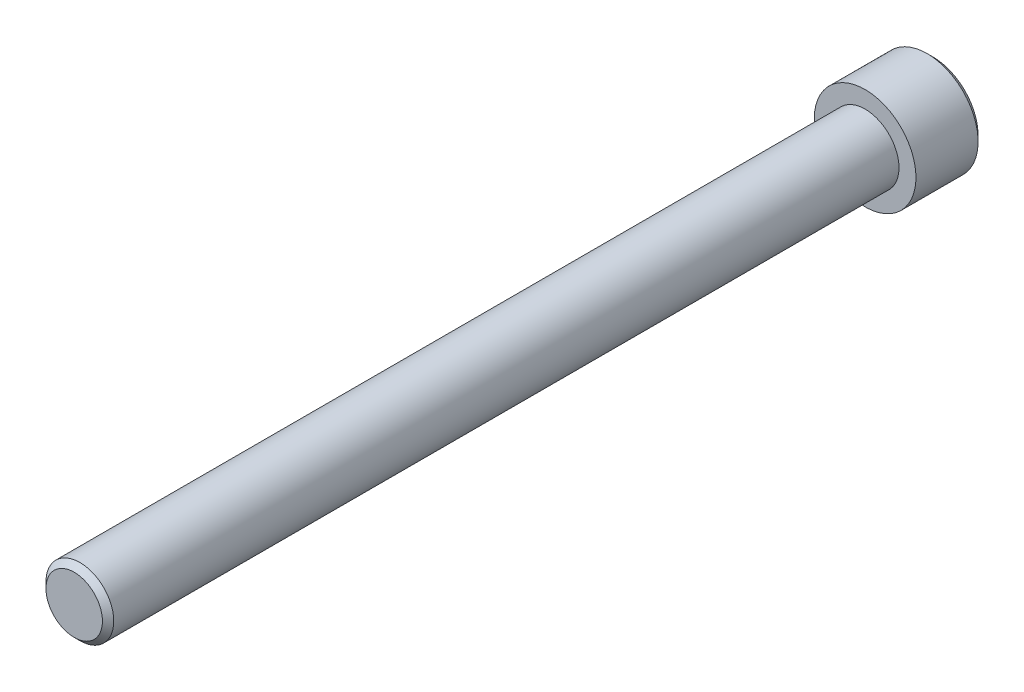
ISO-10303-21;
HEADER;
FILE_DESCRIPTION(('STEP AP214'),'2;1');
FILE_NAME('part.step','',(''),(''),'','','');
FILE_SCHEMA(('AUTOMOTIVE_DESIGN { 1 0 10303 214 1 1 1 1 }'));
ENDSEC;
DATA;
#1=APPLICATION_CONTEXT('core data for automotive mechanical design processes');
#2=APPLICATION_PROTOCOL_DEFINITION('international standard','automotive_design',2000,#1);
#3=PRODUCT_CONTEXT('',#1,'mechanical');
#4=PRODUCT('Part','Part','',(#3));
#5=PRODUCT_RELATED_PRODUCT_CATEGORY('part','',(#4));
#6=PRODUCT_DEFINITION_FORMATION('','',#4);
#7=PRODUCT_DEFINITION_CONTEXT('part definition',#1,'design');
#8=PRODUCT_DEFINITION('design','',#6,#7);
#9=PRODUCT_DEFINITION_SHAPE('','',#8);
#10=(LENGTH_UNIT() NAMED_UNIT(*) SI_UNIT(.MILLI.,.METRE.));
#11=(NAMED_UNIT(*) PLANE_ANGLE_UNIT() SI_UNIT($,.RADIAN.));
#12=(NAMED_UNIT(*) SI_UNIT($,.STERADIAN.) SOLID_ANGLE_UNIT());
#13=UNCERTAINTY_MEASURE_WITH_UNIT(LENGTH_MEASURE(1.E-05),#10,'distance_accuracy_value','');
#14=(GEOMETRIC_REPRESENTATION_CONTEXT(3) GLOBAL_UNCERTAINTY_ASSIGNED_CONTEXT((#13)) GLOBAL_UNIT_ASSIGNED_CONTEXT((#10,
#11,#12)) REPRESENTATION_CONTEXT('',''));
#15=CARTESIAN_POINT('',(0.,0.,0.));
#16=DIRECTION('',(0.,0.,1.));
#17=DIRECTION('',(1.,0.,0.));
#18=AXIS2_PLACEMENT_3D('',#15,#16,#17);
#19=CARTESIAN_POINT('',(-142.,124.,-191.5));
#20=DIRECTION('',(0.,0.,-1.));
#21=DIRECTION('',(-1.,0.,0.));
#22=AXIS2_PLACEMENT_3D('',#19,#20,#21);
#23=PLANE('',#22);
#24=DIRECTION('',(0.5,-0.866025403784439,0.));
#25=VECTOR('',#24,1.);
#26=CARTESIAN_POINT('',(-139.113248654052,129.,-191.5));
#27=LINE('',#26,#25);
#28=CARTESIAN_POINT('',(-139.113248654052,129.,-191.5));
#29=VERTEX_POINT('',#28);
#30=CARTESIAN_POINT('',(-136.226497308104,124.,-191.5));
#31=VERTEX_POINT('',#30);
#32=EDGE_CURVE('E291',#29,#31,#27,.T.);
#33=ORIENTED_EDGE('',*,*,#32,.F.);
#34=DIRECTION('',(1.,0.,0.));
#35=VECTOR('',#34,1.);
#36=CARTESIAN_POINT('',(-144.886751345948,129.,-191.5));
#37=LINE('',#36,#35);
#38=CARTESIAN_POINT('',(-144.886751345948,129.,-191.5));
#39=VERTEX_POINT('',#38);
#40=EDGE_CURVE('E88',#39,#29,#37,.T.);
#41=ORIENTED_EDGE('',*,*,#40,.F.);
#42=DIRECTION('',(0.5,0.866025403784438,0.));
#43=VECTOR('',#42,1.);
#44=CARTESIAN_POINT('',(-147.773502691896,124.,-191.5));
#45=LINE('',#44,#43);
#46=CARTESIAN_POINT('',(-147.773502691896,124.,-191.5));
#47=VERTEX_POINT('',#46);
#48=EDGE_CURVE('E31',#47,#39,#45,.T.);
#49=ORIENTED_EDGE('',*,*,#48,.F.);
#50=DIRECTION('',(-0.5,0.86602540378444,0.));
#51=VECTOR('',#50,1.);
#52=CARTESIAN_POINT('',(-144.886751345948,119.,-191.5));
#53=LINE('',#52,#51);
#54=CARTESIAN_POINT('',(-144.886751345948,119.,-191.5));
#55=VERTEX_POINT('',#54);
#56=EDGE_CURVE('E66',#55,#47,#53,.T.);
#57=ORIENTED_EDGE('',*,*,#56,.F.);
#58=DIRECTION('',(-1.,0.,0.));
#59=VECTOR('',#58,1.);
#60=CARTESIAN_POINT('',(-139.113248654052,119.,-191.5));
#61=LINE('',#60,#59);
#62=CARTESIAN_POINT('',(-139.113248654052,119.,-191.5));
#63=VERTEX_POINT('',#62);
#64=EDGE_CURVE('E76',#63,#55,#61,.T.);
#65=ORIENTED_EDGE('',*,*,#64,.F.);
#66=DIRECTION('',(-0.5,-0.866025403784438,0.));
#67=VECTOR('',#66,1.);
#68=CARTESIAN_POINT('',(-136.226497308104,124.,-191.5));
#69=LINE('',#68,#67);
#70=EDGE_CURVE('E82',#31,#63,#69,.T.);
#71=ORIENTED_EDGE('',*,*,#70,.F.);
#72=EDGE_LOOP('',(#33,#41,#49,#57,#65,#71));
#73=FACE_BOUND('',#72,.T.);
#74=CARTESIAN_POINT('',(-142.,124.,-191.5));
#75=DIRECTION('',(0.,0.,-1.));
#76=DIRECTION('',(-1.,0.,0.));
#77=AXIS2_PLACEMENT_3D('',#74,#75,#76);
#78=CIRCLE('',#77,8.);
#79=CARTESIAN_POINT('',(-150.,124.,-191.5));
#80=VERTEX_POINT('',#79);
#81=EDGE_CURVE('E110',#80,#80,#78,.T.);
#82=ORIENTED_EDGE('',*,*,#81,.T.);
#83=EDGE_LOOP('',(#82));
#84=FACE_BOUND('',#83,.T.);
#85=ADVANCED_FACE('F16',(#73,#84),#23,.T.);
#86=CARTESIAN_POINT('',(-142.,124.,-179.5));
#87=DIRECTION('',(0.,0.,1.));
#88=DIRECTION('',(1.,0.,0.));
#89=AXIS2_PLACEMENT_3D('',#86,#87,#88);
#90=PLANE('',#89);
#91=CARTESIAN_POINT('',(-142.,124.,-179.5));
#92=DIRECTION('',(0.,0.,1.));
#93=DIRECTION('',(1.,0.,0.));
#94=AXIS2_PLACEMENT_3D('',#91,#92,#93);
#95=CIRCLE('',#94,6.);
#96=CARTESIAN_POINT('',(-136.,124.,-179.5));
#97=VERTEX_POINT('',#96);
#98=EDGE_CURVE('E113',#97,#97,#95,.T.);
#99=ORIENTED_EDGE('',*,*,#98,.F.);
#100=EDGE_LOOP('',(#99));
#101=FACE_BOUND('',#100,.T.);
#102=CARTESIAN_POINT('',(-142.,124.,-179.5));
#103=DIRECTION('',(0.,0.,-1.));
#104=DIRECTION('',(-1.,0.,0.));
#105=AXIS2_PLACEMENT_3D('',#102,#103,#104);
#106=CIRCLE('',#105,9.);
#107=CARTESIAN_POINT('',(-151.,124.,-179.5));
#108=VERTEX_POINT('',#107);
#109=EDGE_CURVE('E102',#108,#108,#106,.T.);
#110=ORIENTED_EDGE('',*,*,#109,.F.);
#111=EDGE_LOOP('',(#110));
#112=FACE_BOUND('',#111,.T.);
#113=ADVANCED_FACE('F132',(#101,#112),#90,.T.);
#114=CARTESIAN_POINT('',(-142.,124.,-179.5));
#115=DIRECTION('',(0.,0.,-1.));
#116=DIRECTION('',(-1.,0.,0.));
#117=AXIS2_PLACEMENT_3D('',#114,#115,#116);
#118=CYLINDRICAL_SURFACE('',#117,9.);
#119=CARTESIAN_POINT('',(-142.,124.,-190.5));
#120=DIRECTION('',(0.,0.,-1.));
#121=DIRECTION('',(-1.,0.,0.));
#122=AXIS2_PLACEMENT_3D('',#119,#120,#121);
#123=CIRCLE('',#122,9.);
#124=CARTESIAN_POINT('',(-151.,124.,-190.5));
#125=VERTEX_POINT('',#124);
#126=EDGE_CURVE('E107',#125,#125,#123,.F.);
#127=ORIENTED_EDGE('',*,*,#126,.T.);
#128=EDGE_LOOP('',(#127));
#129=FACE_BOUND('',#128,.T.);
#130=ORIENTED_EDGE('',*,*,#109,.T.);
#131=EDGE_LOOP('',(#130));
#132=FACE_BOUND('',#131,.T.);
#133=ADVANCED_FACE('F137',(#129,#132),#118,.T.);
#134=CARTESIAN_POINT('',(-142.,124.,-190.5));
#135=DIRECTION('',(0.,0.,1.));
#136=DIRECTION('',(1.,0.,0.));
#137=AXIS2_PLACEMENT_3D('',#134,#135,#136);
#138=CONICAL_SURFACE('',#137,9.,0.785398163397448);
#139=ORIENTED_EDGE('',*,*,#81,.F.);
#140=EDGE_LOOP('',(#139));
#141=FACE_BOUND('',#140,.T.);
#142=ORIENTED_EDGE('',*,*,#126,.F.);
#143=EDGE_LOOP('',(#142));
#144=FACE_BOUND('',#143,.T.);
#145=ADVANCED_FACE('F143',(#141,#144),#138,.T.);
#146=CARTESIAN_POINT('',(-139.113248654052,129.,-185.5));
#147=DIRECTION('',(0.866025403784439,0.5,0.));
#148=DIRECTION('',(-0.5,0.866025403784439,0.));
#149=AXIS2_PLACEMENT_3D('',#146,#147,#148);
#150=PLANE('',#149);
#151=ORIENTED_EDGE('',*,*,#32,.T.);
#152=DIRECTION('',(0.,0.,-1.));
#153=VECTOR('',#152,1.);
#154=CARTESIAN_POINT('',(-136.226497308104,124.,-185.5));
#155=LINE('',#154,#153);
#156=CARTESIAN_POINT('',(-136.226497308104,124.,-185.5));
#157=VERTEX_POINT('',#156);
#158=EDGE_CURVE('E100',#157,#31,#155,.T.);
#159=ORIENTED_EDGE('',*,*,#158,.F.);
#160=DIRECTION('',(0.5,-0.866025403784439,0.));
#161=VECTOR('',#160,1.);
#162=CARTESIAN_POINT('',(-139.113248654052,129.,-185.5));
#163=LINE('',#162,#161);
#164=CARTESIAN_POINT('',(-139.113248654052,129.,-185.5));
#165=VERTEX_POINT('',#164);
#166=EDGE_CURVE('E94',#165,#157,#163,.T.);
#167=ORIENTED_EDGE('',*,*,#166,.F.);
#168=DIRECTION('',(0.,0.,-1.));
#169=VECTOR('',#168,1.);
#170=CARTESIAN_POINT('',(-139.113248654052,129.,-185.5));
#171=LINE('',#170,#169);
#172=EDGE_CURVE('E97',#165,#29,#171,.T.);
#173=ORIENTED_EDGE('',*,*,#172,.T.);
#174=EDGE_LOOP('',(#151,#159,#167,#173));
#175=FACE_BOUND('',#174,.T.);
#176=ADVANCED_FACE('F146',(#175),#150,.F.);
#177=CARTESIAN_POINT('',(-136.226497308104,124.,-185.5));
#178=DIRECTION('',(0.866025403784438,-0.5,0.));
#179=DIRECTION('',(0.5,0.866025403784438,0.));
#180=AXIS2_PLACEMENT_3D('',#177,#178,#179);
#181=PLANE('',#180);
#182=ORIENTED_EDGE('',*,*,#70,.T.);
#183=DIRECTION('',(0.,0.,-1.));
#184=VECTOR('',#183,1.);
#185=CARTESIAN_POINT('',(-139.113248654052,119.,-185.5));
#186=LINE('',#185,#184);
#187=CARTESIAN_POINT('',(-139.113248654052,119.,-185.5));
#188=VERTEX_POINT('',#187);
#189=EDGE_CURVE('E72',#188,#63,#186,.T.);
#190=ORIENTED_EDGE('',*,*,#189,.F.);
#191=DIRECTION('',(-0.5,-0.866025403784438,0.));
#192=VECTOR('',#191,1.);
#193=CARTESIAN_POINT('',(-136.226497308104,124.,-185.5));
#194=LINE('',#193,#192);
#195=EDGE_CURVE('E288',#157,#188,#194,.T.);
#196=ORIENTED_EDGE('',*,*,#195,.F.);
#197=ORIENTED_EDGE('',*,*,#158,.T.);
#198=EDGE_LOOP('',(#182,#190,#196,#197));
#199=FACE_BOUND('',#198,.T.);
#200=ADVANCED_FACE('F151',(#199),#181,.F.);
#201=CARTESIAN_POINT('',(-139.113248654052,119.,-185.5));
#202=DIRECTION('',(0.,-1.,0.));
#203=DIRECTION('',(1.,0.,0.));
#204=AXIS2_PLACEMENT_3D('',#201,#202,#203);
#205=PLANE('',#204);
#206=ORIENTED_EDGE('',*,*,#64,.T.);
#207=DIRECTION('',(0.,0.,-1.));
#208=VECTOR('',#207,1.);
#209=CARTESIAN_POINT('',(-144.886751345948,119.,-185.5));
#210=LINE('',#209,#208);
#211=CARTESIAN_POINT('',(-144.886751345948,119.,-185.5));
#212=VERTEX_POINT('',#211);
#213=EDGE_CURVE('E61',#212,#55,#210,.T.);
#214=ORIENTED_EDGE('',*,*,#213,.F.);
#215=DIRECTION('',(-1.,0.,0.));
#216=VECTOR('',#215,1.);
#217=CARTESIAN_POINT('',(-139.113248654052,119.,-185.5));
#218=LINE('',#217,#216);
#219=EDGE_CURVE('E294',#188,#212,#218,.T.);
#220=ORIENTED_EDGE('',*,*,#219,.F.);
#221=ORIENTED_EDGE('',*,*,#189,.T.);
#222=EDGE_LOOP('',(#206,#214,#220,#221));
#223=FACE_BOUND('',#222,.T.);
#224=ADVANCED_FACE('F77',(#223),#205,.F.);
#225=CARTESIAN_POINT('',(-144.886751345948,119.,-185.5));
#226=DIRECTION('',(-0.86602540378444,-0.5,0.));
#227=DIRECTION('',(0.5,-0.86602540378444,0.));
#228=AXIS2_PLACEMENT_3D('',#225,#226,#227);
#229=PLANE('',#228);
#230=ORIENTED_EDGE('',*,*,#56,.T.);
#231=DIRECTION('',(0.,0.,-1.));
#232=VECTOR('',#231,1.);
#233=CARTESIAN_POINT('',(-147.773502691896,124.,-185.5));
#234=LINE('',#233,#232);
#235=CARTESIAN_POINT('',(-147.773502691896,124.,-185.5));
#236=VERTEX_POINT('',#235);
#237=EDGE_CURVE('E73',#236,#47,#234,.T.);
#238=ORIENTED_EDGE('',*,*,#237,.F.);
#239=DIRECTION('',(-0.5,0.86602540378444,0.));
#240=VECTOR('',#239,1.);
#241=CARTESIAN_POINT('',(-144.886751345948,119.,-185.5));
#242=LINE('',#241,#240);
#243=EDGE_CURVE('E69',#212,#236,#242,.T.);
#244=ORIENTED_EDGE('',*,*,#243,.F.);
#245=ORIENTED_EDGE('',*,*,#213,.T.);
#246=EDGE_LOOP('',(#230,#238,#244,#245));
#247=FACE_BOUND('',#246,.T.);
#248=ADVANCED_FACE('F63',(#247),#229,.F.);
#249=CARTESIAN_POINT('',(-147.773502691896,124.,-185.5));
#250=DIRECTION('',(-0.866025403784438,0.5,0.));
#251=DIRECTION('',(-0.5,-0.866025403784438,0.));
#252=AXIS2_PLACEMENT_3D('',#249,#250,#251);
#253=PLANE('',#252);
#254=ORIENTED_EDGE('',*,*,#48,.T.);
#255=DIRECTION('',(0.,0.,-1.));
#256=VECTOR('',#255,1.);
#257=CARTESIAN_POINT('',(-144.886751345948,129.,-185.5));
#258=LINE('',#257,#256);
#259=CARTESIAN_POINT('',(-144.886751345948,129.,-185.5));
#260=VERTEX_POINT('',#259);
#261=EDGE_CURVE('E95',#260,#39,#258,.T.);
#262=ORIENTED_EDGE('',*,*,#261,.F.);
#263=DIRECTION('',(0.5,0.866025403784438,0.));
#264=VECTOR('',#263,1.);
#265=CARTESIAN_POINT('',(-147.773502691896,124.,-185.5));
#266=LINE('',#265,#264);
#267=EDGE_CURVE('E40',#236,#260,#266,.T.);
#268=ORIENTED_EDGE('',*,*,#267,.F.);
#269=ORIENTED_EDGE('',*,*,#237,.T.);
#270=EDGE_LOOP('',(#254,#262,#268,#269));
#271=FACE_BOUND('',#270,.T.);
#272=ADVANCED_FACE('F170',(#271),#253,.F.);
#273=CARTESIAN_POINT('',(-144.886751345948,129.,-185.5));
#274=DIRECTION('',(0.,1.,0.));
#275=DIRECTION('',(-1.,0.,0.));
#276=AXIS2_PLACEMENT_3D('',#273,#274,#275);
#277=PLANE('',#276);
#278=ORIENTED_EDGE('',*,*,#40,.T.);
#279=ORIENTED_EDGE('',*,*,#172,.F.);
#280=DIRECTION('',(1.,0.,0.));
#281=VECTOR('',#280,1.);
#282=CARTESIAN_POINT('',(-144.886751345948,129.,-185.5));
#283=LINE('',#282,#281);
#284=EDGE_CURVE('E104',#260,#165,#283,.T.);
#285=ORIENTED_EDGE('',*,*,#284,.F.);
#286=ORIENTED_EDGE('',*,*,#261,.T.);
#287=EDGE_LOOP('',(#278,#279,#285,#286));
#288=FACE_BOUND('',#287,.T.);
#289=ADVANCED_FACE('F173',(#288),#277,.F.);
#290=CARTESIAN_POINT('',(-139.113248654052,129.,-185.5));
#291=DIRECTION('',(0.43301270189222,0.25,0.866025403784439));
#292=DIRECTION('',(0.894427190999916,0.,-0.447213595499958));
#293=AXIS2_PLACEMENT_3D('',#290,#291,#292);
#294=PLANE('',#293);
#295=ORIENTED_EDGE('',*,*,#166,.T.);
#296=DIRECTION('',(0.894427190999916,0.,-0.447213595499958));
#297=VECTOR('',#296,1.);
#298=CARTESIAN_POINT('',(-138.535898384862,124.,-184.345299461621));
#299=LINE('',#298,#297);
#300=CARTESIAN_POINT('',(-142.,124.,-182.613248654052));
#301=VERTEX_POINT('',#300);
#302=EDGE_CURVE('E281',#301,#157,#299,.T.);
#303=ORIENTED_EDGE('',*,*,#302,.F.);
#304=DIRECTION('',(0.447213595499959,0.774596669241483,-0.447213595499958));
#305=VECTOR('',#304,1.);
#306=CARTESIAN_POINT('',(-140.267949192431,127.,-184.345299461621));
#307=LINE('',#306,#305);
#308=EDGE_CURVE('E284',#301,#165,#307,.T.);
#309=ORIENTED_EDGE('',*,*,#308,.T.);
#310=EDGE_LOOP('',(#295,#303,#309));
#311=FACE_BOUND('',#310,.T.);
#312=ADVANCED_FACE('F176',(#311),#294,.F.);
#313=CARTESIAN_POINT('',(-136.226497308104,124.,-185.5));
#314=DIRECTION('',(0.433012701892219,-0.25,0.866025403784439));
#315=DIRECTION('',(0.894427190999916,0.,-0.447213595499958));
#316=AXIS2_PLACEMENT_3D('',#313,#314,#315);
#317=PLANE('',#316);
#318=ORIENTED_EDGE('',*,*,#195,.T.);
#319=DIRECTION('',(0.447213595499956,-0.774596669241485,-0.447213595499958));
#320=VECTOR('',#319,1.);
#321=CARTESIAN_POINT('',(-140.267949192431,121.,-184.345299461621));
#322=LINE('',#321,#320);
#323=EDGE_CURVE('E314',#301,#188,#322,.T.);
#324=ORIENTED_EDGE('',*,*,#323,.F.);
#325=ORIENTED_EDGE('',*,*,#302,.T.);
#326=EDGE_LOOP('',(#318,#324,#325));
#327=FACE_BOUND('',#326,.T.);
#328=ADVANCED_FACE('F192',(#327),#317,.F.);
#329=CARTESIAN_POINT('',(-139.113248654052,119.,-185.5));
#330=DIRECTION('',(0.,-0.5,0.866025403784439));
#331=DIRECTION('',(0.,-0.866025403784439,-0.5));
#332=AXIS2_PLACEMENT_3D('',#329,#330,#331);
#333=PLANE('',#332);
#334=ORIENTED_EDGE('',*,*,#219,.T.);
#335=DIRECTION('',(-0.447213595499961,-0.774596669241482,-0.447213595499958));
#336=VECTOR('',#335,1.);
#337=CARTESIAN_POINT('',(-143.732050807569,121.,-184.345299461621));
#338=LINE('',#337,#336);
#339=EDGE_CURVE('E315',#301,#212,#338,.T.);
#340=ORIENTED_EDGE('',*,*,#339,.F.);
#341=ORIENTED_EDGE('',*,*,#323,.T.);
#342=EDGE_LOOP('',(#334,#340,#341));
#343=FACE_BOUND('',#342,.T.);
#344=ADVANCED_FACE('F188',(#343),#333,.F.);
#345=CARTESIAN_POINT('',(-144.886751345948,119.,-185.5));
#346=DIRECTION('',(-0.43301270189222,-0.25,0.866025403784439));
#347=DIRECTION('',(0.894427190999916,0.,0.447213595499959));
#348=AXIS2_PLACEMENT_3D('',#345,#346,#347);
#349=PLANE('',#348);
#350=ORIENTED_EDGE('',*,*,#243,.T.);
#351=DIRECTION('',(-0.894427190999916,0.,-0.447213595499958));
#352=VECTOR('',#351,1.);
#353=CARTESIAN_POINT('',(-145.464101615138,124.,-184.345299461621));
#354=LINE('',#353,#352);
#355=EDGE_CURVE('E308',#301,#236,#354,.T.);
#356=ORIENTED_EDGE('',*,*,#355,.F.);
#357=ORIENTED_EDGE('',*,*,#339,.T.);
#358=EDGE_LOOP('',(#350,#356,#357));
#359=FACE_BOUND('',#358,.T.);
#360=ADVANCED_FACE('F185',(#359),#349,.F.);
#361=CARTESIAN_POINT('',(-147.773502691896,124.,-185.5));
#362=DIRECTION('',(-0.433012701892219,0.25,0.866025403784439));
#363=DIRECTION('',(0.894427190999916,0.,0.447213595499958));
#364=AXIS2_PLACEMENT_3D('',#361,#362,#363);
#365=PLANE('',#364);
#366=ORIENTED_EDGE('',*,*,#267,.T.);
#367=DIRECTION('',(-0.447213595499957,0.774596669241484,-0.447213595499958));
#368=VECTOR('',#367,1.);
#369=CARTESIAN_POINT('',(-143.732050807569,127.,-184.345299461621));
#370=LINE('',#369,#368);
#371=EDGE_CURVE('E321',#301,#260,#370,.T.);
#372=ORIENTED_EDGE('',*,*,#371,.F.);
#373=ORIENTED_EDGE('',*,*,#355,.T.);
#374=EDGE_LOOP('',(#366,#372,#373));
#375=FACE_BOUND('',#374,.T.);
#376=ADVANCED_FACE('F181',(#375),#365,.F.);
#377=CARTESIAN_POINT('',(-144.886751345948,129.,-185.5));
#378=DIRECTION('',(0.,0.5,0.866025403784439));
#379=DIRECTION('',(0.,-0.866025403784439,0.5));
#380=AXIS2_PLACEMENT_3D('',#377,#378,#379);
#381=PLANE('',#380);
#382=ORIENTED_EDGE('',*,*,#284,.T.);
#383=ORIENTED_EDGE('',*,*,#308,.F.);
#384=ORIENTED_EDGE('',*,*,#371,.T.);
#385=EDGE_LOOP('',(#382,#383,#384));
#386=FACE_BOUND('',#385,.T.);
#387=ADVANCED_FACE('F178',(#386),#381,.F.);
#388=CARTESIAN_POINT('',(-142.,124.,-39.5));
#389=DIRECTION('',(0.,0.,-1.));
#390=DIRECTION('',(-1.,0.,0.));
#391=AXIS2_PLACEMENT_3D('',#388,#389,#390);
#392=CYLINDRICAL_SURFACE('',#391,6.);
#393=CARTESIAN_POINT('',(-142.,124.,-40.5));
#394=DIRECTION('',(0.,0.,1.));
#395=DIRECTION('',(1.,0.,0.));
#396=AXIS2_PLACEMENT_3D('',#393,#394,#395);
#397=CIRCLE('',#396,6.);
#398=CARTESIAN_POINT('',(-136.,124.,-40.5));
#399=VERTEX_POINT('',#398);
#400=EDGE_CURVE('E24',#399,#399,#397,.F.);
#401=ORIENTED_EDGE('',*,*,#400,.T.);
#402=EDGE_LOOP('',(#401));
#403=FACE_BOUND('',#402,.T.);
#404=ORIENTED_EDGE('',*,*,#98,.T.);
#405=EDGE_LOOP('',(#404));
#406=FACE_BOUND('',#405,.T.);
#407=ADVANCED_FACE('F118',(#403,#406),#392,.T.);
#408=CARTESIAN_POINT('',(-142.,124.,-39.5));
#409=DIRECTION('',(0.,0.,1.));
#410=DIRECTION('',(1.,0.,0.));
#411=AXIS2_PLACEMENT_3D('',#408,#409,#410);
#412=PLANE('',#411);
#413=CARTESIAN_POINT('',(-142.,124.,-39.5));
#414=DIRECTION('',(0.,0.,1.));
#415=DIRECTION('',(1.,0.,0.));
#416=AXIS2_PLACEMENT_3D('',#413,#414,#415);
#417=CIRCLE('',#416,5.);
#418=CARTESIAN_POINT('',(-137.,124.,-39.5));
#419=VERTEX_POINT('',#418);
#420=EDGE_CURVE('E11',#419,#419,#417,.T.);
#421=ORIENTED_EDGE('',*,*,#420,.T.);
#422=EDGE_LOOP('',(#421));
#423=FACE_BOUND('',#422,.T.);
#424=ADVANCED_FACE('F122',(#423),#412,.T.);
#425=CARTESIAN_POINT('',(-142.,124.,-40.5));
#426=DIRECTION('',(0.,0.,-1.));
#427=DIRECTION('',(-1.,0.,0.));
#428=AXIS2_PLACEMENT_3D('',#425,#426,#427);
#429=CONICAL_SURFACE('',#428,6.,0.785398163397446);
#430=ORIENTED_EDGE('',*,*,#420,.F.);
#431=EDGE_LOOP('',(#430));
#432=FACE_BOUND('',#431,.T.);
#433=ORIENTED_EDGE('',*,*,#400,.F.);
#434=EDGE_LOOP('',(#433));
#435=FACE_BOUND('',#434,.T.);
#436=ADVANCED_FACE('F18',(#432,#435),#429,.T.);
#437=CLOSED_SHELL('',(#85,#113,#133,#145,#176,#200,#224,#248,#272,#289,#312,#328,#344,#360,#376,
#387,#407,#424,#436));
#438=MANIFOLD_SOLID_BREP('B1',#437);
#439=ADVANCED_BREP_SHAPE_REPRESENTATION('',(#18,#438),#14);
#440=SHAPE_DEFINITION_REPRESENTATION(#9,#439);
ENDSEC;
END-ISO-10303-21;
